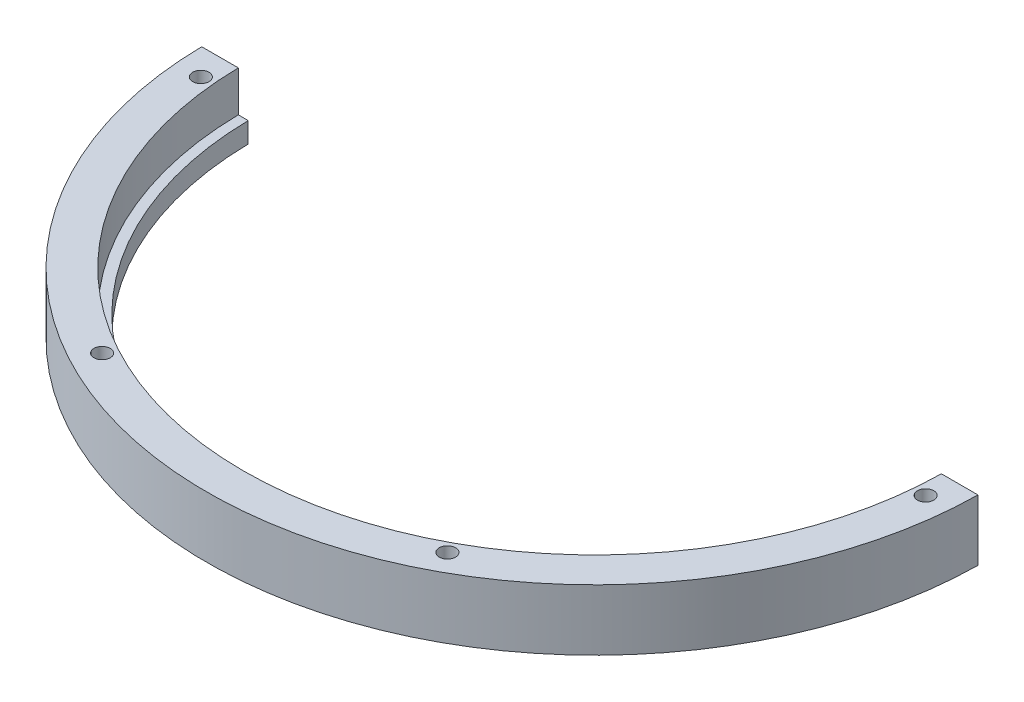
from build123d import *

# Parameters (mm, degrees)
REVOLVE1_ANGLE     = 180
TAPPED_HOLE1_D     = 5.1054
SKETCH4_W          = 264.915937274
SKETCH4_H          = 24.193236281
CUT_EXTRUDE1_DEPTH = 173.488279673


with BuildPart() as part:
    # Sketch1 → Revolve1 (revolve)
    with BuildSketch(Plane.XY):
        Polygon((-121.2215, 6.35), (-106.6927, 6.35), (-106.6927, 12.7), (-109.7915, 12.7), (-109.7915, 25.4), (-121.2215, 25.4), align=None)
    revolve(axis=Axis((0, 0, 0), (0, 1, 0)), revolution_arc=REVOLVE1_ANGLE)

    # Tapped Hole1 (through all)
    with Locations(Plane(origin=(0, 25.4, 0), x_dir=(-1, 0, 0), z_dir=(0, 1, 0))):
        with Locations((-113.169211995, 9.90102311), (-53.915313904, 99.99219834), (113.169211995, 9.90102311), (53.915313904, 99.99219834)):
            Hole(TAPPED_HOLE1_D / 2)

    # Sketch4 → Cut-Extrude1 (cut, through all)
    with BuildSketch(Plane(origin=(0, 25.4, 0), x_dir=(1, 0, 0), z_dir=(0, 1, 0))):
        with Locations((-4.382465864, 10.509118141)):
            Rectangle(SKETCH4_W, SKETCH4_H)
    extrude(amount=-CUT_EXTRUDE1_DEPTH, mode=Mode.SUBTRACT)


solid = part.part
